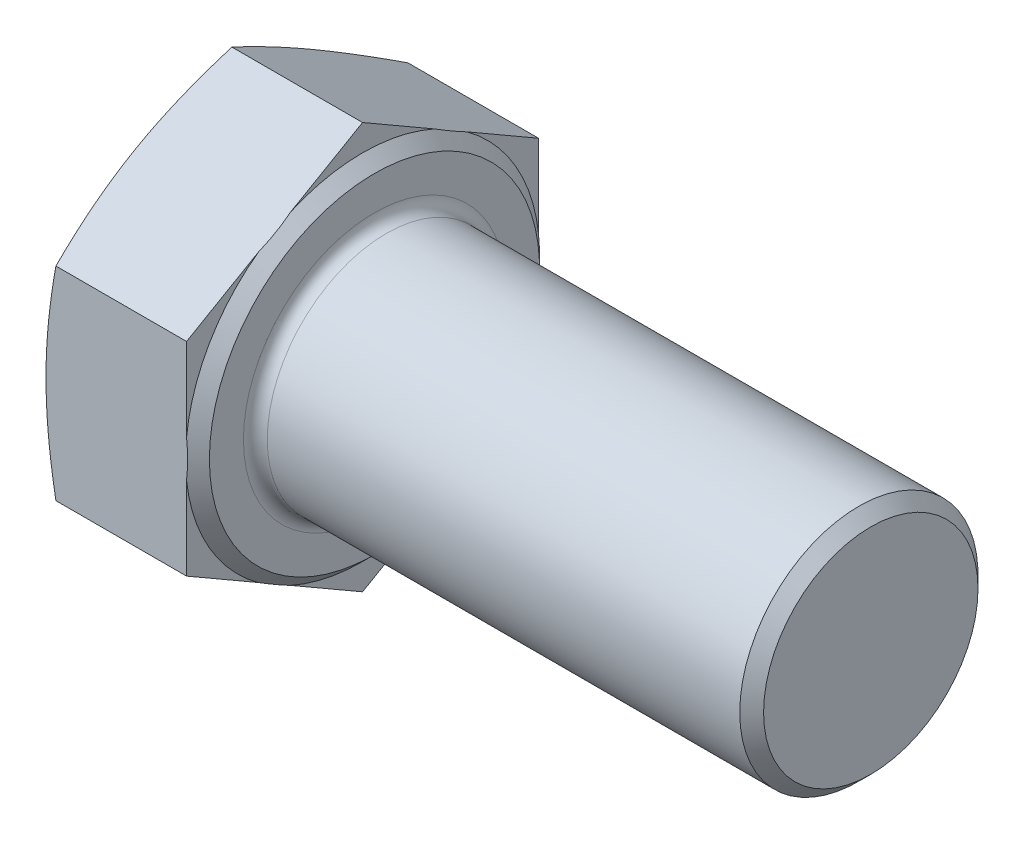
ISO-10303-21;
HEADER;
FILE_DESCRIPTION(('STEP AP214'),'2;1');
FILE_NAME('part.step','',(''),(''),'','','');
FILE_SCHEMA(('AUTOMOTIVE_DESIGN { 1 0 10303 214 1 1 1 1 }'));
ENDSEC;
DATA;
#1=APPLICATION_CONTEXT('core data for automotive mechanical design processes');
#2=APPLICATION_PROTOCOL_DEFINITION('international standard','automotive_design',2000,#1);
#3=PRODUCT_CONTEXT('',#1,'mechanical');
#4=PRODUCT('Part','Part','',(#3));
#5=PRODUCT_RELATED_PRODUCT_CATEGORY('part','',(#4));
#6=PRODUCT_DEFINITION_FORMATION('','',#4);
#7=PRODUCT_DEFINITION_CONTEXT('part definition',#1,'design');
#8=PRODUCT_DEFINITION('design','',#6,#7);
#9=PRODUCT_DEFINITION_SHAPE('','',#8);
#10=(LENGTH_UNIT() NAMED_UNIT(*) SI_UNIT(.MILLI.,.METRE.));
#11=(NAMED_UNIT(*) PLANE_ANGLE_UNIT() SI_UNIT($,.RADIAN.));
#12=(NAMED_UNIT(*) SI_UNIT($,.STERADIAN.) SOLID_ANGLE_UNIT());
#13=UNCERTAINTY_MEASURE_WITH_UNIT(LENGTH_MEASURE(1.E-05),#10,'distance_accuracy_value','');
#14=(GEOMETRIC_REPRESENTATION_CONTEXT(3) GLOBAL_UNCERTAINTY_ASSIGNED_CONTEXT((#13)) GLOBAL_UNIT_ASSIGNED_CONTEXT((#10,
#11,#12)) REPRESENTATION_CONTEXT('',''));
#15=CARTESIAN_POINT('',(0.,0.,0.));
#16=DIRECTION('',(0.,0.,1.));
#17=DIRECTION('',(1.,0.,0.));
#18=AXIS2_PLACEMENT_3D('',#15,#16,#17);
#19=CARTESIAN_POINT('',(7.68,-5.11821013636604,-8.865));
#20=DIRECTION('',(1.,0.,0.));
#21=DIRECTION('',(0.,0.,-1.));
#22=AXIS2_PLACEMENT_3D('',#19,#20,#21);
#23=PLANE('',#22);
#24=CARTESIAN_POINT('',(7.68,0.,0.));
#25=DIRECTION('',(1.,0.,0.));
#26=DIRECTION('',(0.,0.,-1.));
#27=AXIS2_PLACEMENT_3D('',#24,#25,#26);
#28=CIRCLE('',#27,6.6);
#29=CARTESIAN_POINT('',(7.68,0.,-6.6));
#30=VERTEX_POINT('',#29);
#31=EDGE_CURVE('E11',#30,#30,#28,.F.);
#32=ORIENTED_EDGE('',*,*,#31,.T.);
#33=EDGE_LOOP('',(#32));
#34=FACE_BOUND('',#33,.T.);
#35=CARTESIAN_POINT('',(7.68,0.,0.));
#36=DIRECTION('',(-1.,0.,0.));
#37=DIRECTION('',(0.,0.,1.));
#38=AXIS2_PLACEMENT_3D('',#35,#36,#37);
#39=CIRCLE('',#38,8.315);
#40=CARTESIAN_POINT('',(7.68,0.,8.315));
#41=VERTEX_POINT('',#40);
#42=EDGE_CURVE('E393',#41,#41,#39,.T.);
#43=ORIENTED_EDGE('',*,*,#42,.F.);
#44=EDGE_LOOP('',(#43));
#45=FACE_BOUND('',#44,.T.);
#46=ADVANCED_FACE('F34',(#34,#45),#23,.T.);
#47=CARTESIAN_POINT('',(7.68,-10.2364202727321,0.));
#48=DIRECTION('',(0.,0.866025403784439,0.5));
#49=DIRECTION('',(0.,-0.5,0.866025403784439));
#50=AXIS2_PLACEMENT_3D('',#47,#48,#49);
#51=PLANE('',#50);
#52=CARTESIAN_POINT('',(0.499198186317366,-5.1180946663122,-8.8652));
#53=CARTESIAN_POINT('',(0.422020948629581,-5.33006052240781,-8.49806436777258));
#54=CARTESIAN_POINT('',(0.351814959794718,-5.542725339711,-8.1297180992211));
#55=CARTESIAN_POINT('',(0.228298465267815,-5.96943771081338,-7.39063059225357));
#56=CARTESIAN_POINT('',(0.175001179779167,-6.18348621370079,-7.01988770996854));
#57=CARTESIAN_POINT('',(0.0887943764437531,-6.61059056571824,-6.28012127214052));
#58=CARTESIAN_POINT('',(0.0556968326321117,-6.82363666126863,-5.91111461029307));
#59=CARTESIAN_POINT('',(0.0113037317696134,-7.25022705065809,-5.17223838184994));
#60=CARTESIAN_POINT('',(0.,-7.46377112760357,-4.80236919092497));
#61=CARTESIAN_POINT('',(0.,-7.89085928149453,-4.06263080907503));
#62=CARTESIAN_POINT('',(0.0113037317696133,-8.10440335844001,-3.69276161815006));
#63=CARTESIAN_POINT('',(0.0556968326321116,-8.53099374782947,-2.95388538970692));
#64=CARTESIAN_POINT('',(0.0887943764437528,-8.74403984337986,-2.58487872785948));
#65=CARTESIAN_POINT('',(0.175001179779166,-9.17114419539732,-1.84511229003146));
#66=CARTESIAN_POINT('',(0.228298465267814,-9.38519269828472,-1.47436940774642));
#67=CARTESIAN_POINT('',(0.351814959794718,-9.81190506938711,-0.735281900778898));
#68=CARTESIAN_POINT('',(0.422020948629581,-10.0245698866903,-0.366935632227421));
#69=CARTESIAN_POINT('',(0.499198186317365,-10.2365357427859,0.000199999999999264));
#70=B_SPLINE_CURVE_WITH_KNOTS('',3,(#52,#53,#54,#55,#56,#57,#58,#59,#60,#61,#62,#63,#64,#65,#66,
#67,#68,#69),.UNSPECIFIED.,.F.,.F.,(4,2,2,2,2,2,2,2,4),(0.,1.29283198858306,2.58667231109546,
3.86827775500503,5.14940238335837,6.43052701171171,7.71213245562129,9.00597277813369,
10.2988047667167),.UNSPECIFIED.);
#71=CARTESIAN_POINT('',(0.4991561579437,-5.11821013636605,-8.865));
#72=VERTEX_POINT('',#71);
#73=CARTESIAN_POINT('',(0.,-7.67731520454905,-4.4325));
#74=VERTEX_POINT('',#73);
#75=EDGE_CURVE('E149',#72,#74,#70,.T.);
#76=ORIENTED_EDGE('',*,*,#75,.F.);
#77=DIRECTION('',(-1.,0.,0.));
#78=VECTOR('',#77,1.);
#79=CARTESIAN_POINT('',(7.68,-5.11821013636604,-8.865));
#80=LINE('',#79,#78);
#81=CARTESIAN_POINT('',(7.08,-5.11821013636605,-8.865));
#82=VERTEX_POINT('',#81);
#83=EDGE_CURVE('E178',#82,#72,#80,.T.);
#84=ORIENTED_EDGE('',*,*,#83,.F.);
#85=DIRECTION('',(0.,0.5,-0.866025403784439));
#86=VECTOR('',#85,1.);
#87=CARTESIAN_POINT('',(7.08,-10.2364202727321,0.));
#88=LINE('',#87,#86);
#89=CARTESIAN_POINT('',(7.08,-7.20588122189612,-5.24904761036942));
#90=VERTEX_POINT('',#89);
#91=EDGE_CURVE('E358',#90,#82,#88,.T.);
#92=ORIENTED_EDGE('',*,*,#91,.F.);
#93=CARTESIAN_POINT('',(7.0798,-8.14969377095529,-3.61431632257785));
#94=CARTESIAN_POINT('',(7.11326666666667,-7.99223424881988,-3.8870442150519));
#95=CARTESIAN_POINT('',(7.13,-7.83477472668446,-4.15977210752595));
#96=CARTESIAN_POINT('',(7.13,-7.51985568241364,-4.70522789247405));
#97=CARTESIAN_POINT('',(7.11326666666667,-7.36239616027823,-4.9779557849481));
#98=CARTESIAN_POINT('',(7.0798,-7.20493663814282,-5.25068367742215));
#99=B_SPLINE_CURVE_WITH_KNOTS('',3,(#93,#94,#95,#96,#97,#98),.UNSPECIFIED.,.F.,.F.,(4,2,4),(0.,
0.946089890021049,1.8921797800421),.UNSPECIFIED.);
#100=CARTESIAN_POINT('',(7.08,-8.14874918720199,-3.61595238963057));
#101=VERTEX_POINT('',#100);
#102=EDGE_CURVE('E298',#101,#90,#99,.T.);
#103=ORIENTED_EDGE('',*,*,#102,.F.);
#104=CARTESIAN_POINT('',(7.08,-10.2364202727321,0.));
#105=VERTEX_POINT('',#104);
#106=EDGE_CURVE('E362',#105,#101,#88,.T.);
#107=ORIENTED_EDGE('',*,*,#106,.F.);
#108=DIRECTION('',(-1.,0.,0.));
#109=VECTOR('',#108,1.);
#110=CARTESIAN_POINT('',(7.68,-10.2364202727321,0.));
#111=LINE('',#110,#109);
#112=CARTESIAN_POINT('',(0.4991561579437,-10.2364202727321,0.));
#113=VERTEX_POINT('',#112);
#114=EDGE_CURVE('E172',#105,#113,#111,.T.);
#115=ORIENTED_EDGE('',*,*,#114,.T.);
#116=EDGE_CURVE('E267',#74,#113,#70,.T.);
#117=ORIENTED_EDGE('',*,*,#116,.F.);
#118=EDGE_LOOP('',(#76,#84,#92,#103,#107,#115,#117));
#119=FACE_BOUND('',#118,.T.);
#120=ADVANCED_FACE('F36',(#119),#51,.F.);
#121=CARTESIAN_POINT('',(7.68,-5.11821013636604,-8.865));
#122=DIRECTION('',(0.,0.,1.));
#123=DIRECTION('',(1.,0.,0.));
#124=AXIS2_PLACEMENT_3D('',#121,#122,#123);
#125=PLANE('',#124);
#126=CARTESIAN_POINT('',(2.66729255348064,-13.5512207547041,-8.865));
#127=CARTESIAN_POINT('',(2.54516242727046,-13.1501360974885,-8.865));
#128=CARTESIAN_POINT('',(2.42445740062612,-12.7486094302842,-8.865));
#129=CARTESIAN_POINT('',(2.1866859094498,-11.9444470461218,-8.865));
#130=CARTESIAN_POINT('',(2.06961973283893,-11.5418112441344,-8.865));
#131=CARTESIAN_POINT('',(1.83971956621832,-10.7345164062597,-8.865));
#132=CARTESIAN_POINT('',(1.72689387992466,-10.3298549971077,-8.865));
#133=CARTESIAN_POINT('',(1.50679557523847,-9.51902688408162,-8.865));
#134=CARTESIAN_POINT('',(1.39952285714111,-9.1128602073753,-8.865));
#135=CARTESIAN_POINT('',(1.19318564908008,-8.30376994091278,-8.865));
#136=CARTESIAN_POINT('',(1.09403626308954,-7.9008681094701,-8.865));
#137=CARTESIAN_POINT('',(0.904178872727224,-7.09305955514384,-8.865));
#138=CARTESIAN_POINT('',(0.813471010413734,-6.68815279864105,-8.865));
#139=CARTESIAN_POINT('',(0.642611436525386,-5.87624379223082,-8.865));
#140=CARTESIAN_POINT('',(0.562456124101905,-5.46924230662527,-8.865));
#141=CARTESIAN_POINT('',(0.415142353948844,-4.65287640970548,-8.865));
#142=CARTESIAN_POINT('',(0.347983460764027,-4.2435120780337,-8.865));
#143=CARTESIAN_POINT('',(0.236040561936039,-3.46851652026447,-8.865));
#144=CARTESIAN_POINT('',(0.18959213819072,-3.10312796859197,-8.865));
#145=CARTESIAN_POINT('',(0.110966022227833,-2.37080582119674,-8.865));
#146=CARTESIAN_POINT('',(0.0787879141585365,-2.00387227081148,-8.865));
#147=CARTESIAN_POINT('',(0.0302520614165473,-1.26920440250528,-8.865));
#148=CARTESIAN_POINT('',(0.0138831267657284,-0.901470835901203,-8.865));
#149=CARTESIAN_POINT('',(-0.00220562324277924,-0.165635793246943,-8.865));
#150=CARTESIAN_POINT('',(-0.0019255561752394,0.202465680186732,-8.865));
#151=CARTESIAN_POINT('',(0.0153120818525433,0.940139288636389,-8.865));
#152=CARTESIAN_POINT('',(0.0323542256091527,1.30970941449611,-8.865));
#153=CARTESIAN_POINT('',(0.0823317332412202,2.04776414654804,-8.865));
#154=CARTESIAN_POINT('',(0.115267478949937,2.41624872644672,-8.865));
#155=CARTESIAN_POINT('',(0.195491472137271,3.15195041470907,-8.865));
#156=CARTESIAN_POINT('',(0.242792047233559,3.51916615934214,-8.865));
#157=CARTESIAN_POINT('',(0.349827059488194,4.25176055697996,-8.865));
#158=CARTESIAN_POINT('',(0.409561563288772,4.61713920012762,-8.865));
#159=CARTESIAN_POINT('',(0.542957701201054,5.36528645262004,-8.865));
#160=CARTESIAN_POINT('',(0.617188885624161,5.74795260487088,-8.865));
#161=CARTESIAN_POINT('',(0.775205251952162,6.5113198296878,-8.865));
#162=CARTESIAN_POINT('',(0.858991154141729,6.89202075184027,-8.865));
#163=CARTESIAN_POINT('',(1.03435761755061,7.6517288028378,-8.865));
#164=CARTESIAN_POINT('',(1.12594044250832,8.03073540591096,-8.865));
#165=CARTESIAN_POINT('',(1.31541098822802,8.78715202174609,-8.865));
#166=CARTESIAN_POINT('',(1.41329855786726,9.16456207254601,-8.865));
#167=CARTESIAN_POINT('',(1.61432901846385,9.91849411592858,-8.865));
#168=CARTESIAN_POINT('',(1.71747849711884,10.2950143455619,-8.865));
#169=CARTESIAN_POINT('',(1.92797370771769,11.0468783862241,-8.865));
#170=CARTESIAN_POINT('',(2.03531945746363,11.4222221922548,-8.865));
#171=CARTESIAN_POINT('',(2.25343759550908,12.1718406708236,-8.865));
#172=CARTESIAN_POINT('',(2.36420939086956,12.5461155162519,-8.865));
#173=CARTESIAN_POINT('',(2.58860690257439,13.2938096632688,-8.865));
#174=CARTESIAN_POINT('',(2.70223263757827,13.6672289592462,-8.865));
#175=CARTESIAN_POINT('',(3.04411686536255,14.7781527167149,-8.865));
#176=CARTESIAN_POINT('',(3.2758154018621,15.5145983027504,-8.865));
#177=CARTESIAN_POINT('',(3.74577835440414,16.9854197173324,-8.865));
#178=CARTESIAN_POINT('',(3.98404308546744,17.7197954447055,-8.865));
#179=CARTESIAN_POINT('',(4.4644742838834,19.1841817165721,-8.865));
#180=CARTESIAN_POINT('',(4.70662251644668,19.9141982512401,-8.865));
#181=CARTESIAN_POINT('',(5.07253100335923,21.0082896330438,-8.865));
#182=CARTESIAN_POINT('',(5.19494320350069,21.3728165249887,-8.865));
#183=CARTESIAN_POINT('',(5.44055969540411,22.1016024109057,-8.865));
#184=CARTESIAN_POINT('',(5.56376398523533,22.4658614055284,-8.865));
#185=CARTESIAN_POINT('',(5.68731140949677,22.8300040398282,-8.865));
#186=B_SPLINE_CURVE_WITH_KNOTS('',3,(#126,#127,#128,#129,#130,#131,#132,#133,#134,#135,#136,
#137,#138,#139,#140,#141,#142,#143,#144,#145,#146,#147,#148,#149,#150,#151,#152,#153,#154,#155,
#156,#157,#158,#159,#160,#161,#162,#163,#164,#165,#166,#167,#168,#169,#170,#171,#172,#173,#174,
#175,#176,#177,#178,#179,#180,#181,#182,#183,#184,#185),.UNSPECIFIED.,.F.,.F.,(4,2,2,2,2,2,2,2,
2,2,2,2,2,2,2,2,2,2,2,2,2,2,2,2,2,2,2,2,2,4),(0.,1.25780938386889,2.51571803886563,
3.77597363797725,5.03620660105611,6.28090154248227,7.52561742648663,8.76990746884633,
10.0141558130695,11.118900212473,12.2236124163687,13.3275421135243,14.4314640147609,
15.5409844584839,16.6505315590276,17.7610335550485,18.8715415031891,20.0407904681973,
21.2101276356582,22.379805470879,23.5494552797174,24.7206072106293,25.8917641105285,
27.0627194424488,28.233682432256,30.549734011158,32.8658968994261,35.1732714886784,
36.3268658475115,37.4804573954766),.UNSPECIFIED.);
#187=CARTESIAN_POINT('',(0.4991561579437,5.11821013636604,-8.865));
#188=VERTEX_POINT('',#187);
#189=CARTESIAN_POINT('',(0.,0.,-8.865));
#190=VERTEX_POINT('',#189);
#191=EDGE_CURVE('E278',#188,#190,#186,.F.);
#192=ORIENTED_EDGE('',*,*,#191,.F.);
#193=DIRECTION('',(-1.,0.,0.));
#194=VECTOR('',#193,1.);
#195=CARTESIAN_POINT('',(7.68,5.11821013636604,-8.865));
#196=LINE('',#195,#194);
#197=CARTESIAN_POINT('',(7.08,5.11821013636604,-8.865));
#198=VERTEX_POINT('',#197);
#199=EDGE_CURVE('E169',#198,#188,#196,.T.);
#200=ORIENTED_EDGE('',*,*,#199,.F.);
#201=DIRECTION('',(0.,1.,0.));
#202=VECTOR('',#201,1.);
#203=CARTESIAN_POINT('',(7.08,-5.11821013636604,-8.865));
#204=LINE('',#203,#202);
#205=CARTESIAN_POINT('',(7.08,0.942867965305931,-8.865));
#206=VERTEX_POINT('',#205);
#207=EDGE_CURVE('E355',#206,#198,#204,.T.);
#208=ORIENTED_EDGE('',*,*,#207,.F.);
#209=CARTESIAN_POINT('',(5.91281716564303,-4.80231045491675,-8.865));
#210=CARTESIAN_POINT('',(6.04763585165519,-4.51913406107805,-8.865));
#211=CARTESIAN_POINT('',(6.17515621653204,-4.23218217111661,-8.865));
#212=CARTESIAN_POINT('',(6.41179256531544,-3.64979088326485,-8.865));
#213=CARTESIAN_POINT('',(6.52085004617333,-3.35432785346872,-8.865));
#214=CARTESIAN_POINT('',(6.71521118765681,-2.75773602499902,-8.865));
#215=CARTESIAN_POINT('',(6.80066844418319,-2.4566581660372,-8.865));
#216=CARTESIAN_POINT('',(6.94417783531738,-1.84830814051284,-8.865));
#217=CARTESIAN_POINT('',(7.00226551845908,-1.54104455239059,-8.865));
#218=CARTESIAN_POINT('',(7.07505877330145,-1.01216911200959,-8.865));
#219=CARTESIAN_POINT('',(7.0974646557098,-0.791603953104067,-8.865));
#220=CARTESIAN_POINT('',(7.12586090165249,-0.349369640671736,-8.865));
#221=CARTESIAN_POINT('',(7.13184932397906,-0.127700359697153,-8.865));
#222=CARTESIAN_POINT('',(7.12715498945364,0.315604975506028,-8.865));
#223=CARTESIAN_POINT('',(7.11646134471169,0.53724091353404,-8.865));
#224=CARTESIAN_POINT('',(7.07881745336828,0.979071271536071,-8.865));
#225=CARTESIAN_POINT('',(7.05186917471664,1.19926586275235,-8.865));
#226=CARTESIAN_POINT('',(6.96538716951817,1.74660590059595,-8.865));
#227=CARTESIAN_POINT('',(6.89630201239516,2.07226255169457,-8.865));
#228=CARTESIAN_POINT('',(6.72846287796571,2.71615698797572,-8.865));
#229=CARTESIAN_POINT('',(6.62966369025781,3.03438266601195,-8.865));
#230=CARTESIAN_POINT('',(6.40734934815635,3.66358844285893,-8.865));
#231=CARTESIAN_POINT('',(6.28372531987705,3.97452963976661,-8.865));
#232=CARTESIAN_POINT('',(6.08393757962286,4.43394346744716,-8.865));
#233=CARTESIAN_POINT('',(6.01507836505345,4.58566409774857,-8.865));
#234=CARTESIAN_POINT('',(5.87306150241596,4.88702722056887,-8.865));
#235=CARTESIAN_POINT('',(5.7999051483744,5.03667032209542,-8.865));
#236=CARTESIAN_POINT('',(5.72484319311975,5.18535397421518,-8.865));
#237=B_SPLINE_CURVE_WITH_KNOTS('',3,(#209,#210,#211,#212,#213,#214,#215,#216,#217,#218,#219,
#220,#221,#222,#223,#224,#225,#226,#227,#228,#229,#230,#231,#232,#233,#234,#235,#236),
.UNSPECIFIED.,.F.,.F.,(4,2,2,2,2,2,2,2,2,2,2,2,2,4),(0.,0.941201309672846,1.88533132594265,
2.82316358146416,3.75977436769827,4.42431513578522,5.08893447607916,5.75398777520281,
6.41896057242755,7.4159233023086,8.41441066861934,9.41737667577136,9.9171701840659,
10.4168139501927),.UNSPECIFIED.);
#238=CARTESIAN_POINT('',(7.08,-0.942867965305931,-8.865));
#239=VERTEX_POINT('',#238);
#240=EDGE_CURVE('E292',#239,#206,#237,.T.);
#241=ORIENTED_EDGE('',*,*,#240,.F.);
#242=EDGE_CURVE('E356',#82,#239,#204,.T.);
#243=ORIENTED_EDGE('',*,*,#242,.F.);
#244=ORIENTED_EDGE('',*,*,#83,.T.);
#245=EDGE_CURVE('E160',#190,#72,#186,.F.);
#246=ORIENTED_EDGE('',*,*,#245,.F.);
#247=EDGE_LOOP('',(#192,#200,#208,#241,#243,#244,#246));
#248=FACE_BOUND('',#247,.T.);
#249=ADVANCED_FACE('F218',(#248),#125,.F.);
#250=CARTESIAN_POINT('',(7.68,5.11821013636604,-8.865));
#251=DIRECTION('',(0.,-0.866025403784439,0.5));
#252=DIRECTION('',(0.,-0.5,-0.866025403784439));
#253=AXIS2_PLACEMENT_3D('',#250,#251,#252);
#254=PLANE('',#253);
#255=CARTESIAN_POINT('',(0.499198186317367,10.2365357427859,0.000199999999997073));
#256=CARTESIAN_POINT('',(0.422020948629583,10.0245698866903,-0.366935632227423));
#257=CARTESIAN_POINT('',(0.35181495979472,9.81190506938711,-0.7352819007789));
#258=CARTESIAN_POINT('',(0.228298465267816,9.38519269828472,-1.47436940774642));
#259=CARTESIAN_POINT('',(0.175001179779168,9.17114419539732,-1.84511229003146));
#260=CARTESIAN_POINT('',(0.0887943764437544,8.74403984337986,-2.58487872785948));
#261=CARTESIAN_POINT('',(0.0556968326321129,8.53099374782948,-2.95388538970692));
#262=CARTESIAN_POINT('',(0.0113037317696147,8.10440335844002,-3.69276161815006));
#263=CARTESIAN_POINT('',(0.,7.89085928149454,-4.06263080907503));
#264=CARTESIAN_POINT('',(0.,7.46377112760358,-4.80236919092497));
#265=CARTESIAN_POINT('',(0.0113037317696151,7.2502270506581,-5.17223838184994));
#266=CARTESIAN_POINT('',(0.0556968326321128,6.82363666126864,-5.91111461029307));
#267=CARTESIAN_POINT('',(0.0887943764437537,6.61059056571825,-6.28012127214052));
#268=CARTESIAN_POINT('',(0.175001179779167,6.18348621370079,-7.01988770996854));
#269=CARTESIAN_POINT('',(0.228298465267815,5.96943771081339,-7.39063059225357));
#270=CARTESIAN_POINT('',(0.351814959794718,5.542725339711,-8.1297180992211));
#271=CARTESIAN_POINT('',(0.422020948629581,5.33006052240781,-8.49806436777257));
#272=CARTESIAN_POINT('',(0.499198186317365,5.1180946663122,-8.86519999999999));
#273=B_SPLINE_CURVE_WITH_KNOTS('',3,(#255,#256,#257,#258,#259,#260,#261,#262,#263,#264,#265,
#266,#267,#268,#269,#270,#271,#272),.UNSPECIFIED.,.F.,.F.,(4,2,2,2,2,2,2,2,4),(0.,
1.29283198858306,2.58667231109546,3.86827775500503,5.14940238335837,6.43052701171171,
7.71213245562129,9.00597277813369,10.2988047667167),.UNSPECIFIED.);
#274=CARTESIAN_POINT('',(0.4991561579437,10.2364202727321,0.));
#275=VERTEX_POINT('',#274);
#276=CARTESIAN_POINT('',(0.,7.67731520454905,-4.4325));
#277=VERTEX_POINT('',#276);
#278=EDGE_CURVE('E50',#275,#277,#273,.T.);
#279=ORIENTED_EDGE('',*,*,#278,.F.);
#280=DIRECTION('',(-1.,0.,0.));
#281=VECTOR('',#280,1.);
#282=CARTESIAN_POINT('',(7.68,10.2364202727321,0.));
#283=LINE('',#282,#281);
#284=CARTESIAN_POINT('',(7.08,10.2364202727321,0.));
#285=VERTEX_POINT('',#284);
#286=EDGE_CURVE('E166',#285,#275,#283,.T.);
#287=ORIENTED_EDGE('',*,*,#286,.F.);
#288=DIRECTION('',(0.,0.5,0.866025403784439));
#289=VECTOR('',#288,1.);
#290=CARTESIAN_POINT('',(7.08,5.11821013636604,-8.865));
#291=LINE('',#290,#289);
#292=CARTESIAN_POINT('',(7.08,8.14874918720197,-3.61595238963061));
#293=VERTEX_POINT('',#292);
#294=EDGE_CURVE('E347',#293,#285,#291,.T.);
#295=ORIENTED_EDGE('',*,*,#294,.F.);
#296=CARTESIAN_POINT('',(7.0798,7.20493663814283,-5.25068367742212));
#297=CARTESIAN_POINT('',(7.11326666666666,7.36239616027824,-4.97795578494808));
#298=CARTESIAN_POINT('',(7.13,7.51985568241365,-4.70522789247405));
#299=CARTESIAN_POINT('',(7.13,7.83477472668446,-4.15977210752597));
#300=CARTESIAN_POINT('',(7.11326666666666,7.99223424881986,-3.88704421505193));
#301=CARTESIAN_POINT('',(7.0798,8.14969377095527,-3.61431632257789));
#302=B_SPLINE_CURVE_WITH_KNOTS('',3,(#296,#297,#298,#299,#300,#301),.UNSPECIFIED.,.F.,.F.,(4,2,
4),(0.,0.946089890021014,1.89217978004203),.UNSPECIFIED.);
#303=CARTESIAN_POINT('',(7.08,7.20588122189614,-5.2490476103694));
#304=VERTEX_POINT('',#303);
#305=EDGE_CURVE('E299',#304,#293,#302,.T.);
#306=ORIENTED_EDGE('',*,*,#305,.F.);
#307=EDGE_CURVE('E350',#198,#304,#291,.T.);
#308=ORIENTED_EDGE('',*,*,#307,.F.);
#309=ORIENTED_EDGE('',*,*,#199,.T.);
#310=EDGE_CURVE('E279',#277,#188,#273,.T.);
#311=ORIENTED_EDGE('',*,*,#310,.F.);
#312=EDGE_LOOP('',(#279,#287,#295,#306,#308,#309,#311));
#313=FACE_BOUND('',#312,.T.);
#314=ADVANCED_FACE('F287',(#313),#254,.F.);
#315=CARTESIAN_POINT('',(7.68,10.2364202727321,0.));
#316=DIRECTION('',(0.,-0.866025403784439,-0.5));
#317=DIRECTION('',(0.,0.5,-0.866025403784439));
#318=AXIS2_PLACEMENT_3D('',#315,#316,#317);
#319=PLANE('',#318);
#320=CARTESIAN_POINT('',(0.499198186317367,5.1180946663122,8.8652));
#321=CARTESIAN_POINT('',(0.422020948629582,5.33006052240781,8.49806436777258));
#322=CARTESIAN_POINT('',(0.351814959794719,5.54272533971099,8.1297180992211));
#323=CARTESIAN_POINT('',(0.228298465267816,5.96943771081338,7.39063059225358));
#324=CARTESIAN_POINT('',(0.175001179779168,6.18348621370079,7.01988770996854));
#325=CARTESIAN_POINT('',(0.088794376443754,6.61059056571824,6.28012127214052));
#326=CARTESIAN_POINT('',(0.0556968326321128,6.82363666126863,5.91111461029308));
#327=CARTESIAN_POINT('',(0.0113037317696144,7.25022705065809,5.17223838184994));
#328=CARTESIAN_POINT('',(0.,7.46377112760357,4.80236919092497));
#329=CARTESIAN_POINT('',(0.,7.89085928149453,4.06263080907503));
#330=CARTESIAN_POINT('',(0.0113037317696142,8.10440335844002,3.69276161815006));
#331=CARTESIAN_POINT('',(0.0556968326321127,8.53099374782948,2.95388538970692));
#332=CARTESIAN_POINT('',(0.088794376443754,8.74403984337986,2.58487872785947));
#333=CARTESIAN_POINT('',(0.175001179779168,9.17114419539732,1.84511229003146));
#334=CARTESIAN_POINT('',(0.228298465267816,9.38519269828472,1.47436940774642));
#335=CARTESIAN_POINT('',(0.351814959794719,9.81190506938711,0.735281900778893));
#336=CARTESIAN_POINT('',(0.422020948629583,10.0245698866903,0.366935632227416));
#337=CARTESIAN_POINT('',(0.499198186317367,10.2365357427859,-0.000200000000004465));
#338=B_SPLINE_CURVE_WITH_KNOTS('',3,(#320,#321,#322,#323,#324,#325,#326,#327,#328,#329,#330,
#331,#332,#333,#334,#335,#336,#337),.UNSPECIFIED.,.F.,.F.,(4,2,2,2,2,2,2,2,4),(0.,
1.29283198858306,2.58667231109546,3.86827775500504,5.14940238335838,6.43052701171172,
7.7121324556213,9.0059727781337,10.2988047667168),.UNSPECIFIED.);
#339=CARTESIAN_POINT('',(0.4991561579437,5.11821013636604,8.865));
#340=VERTEX_POINT('',#339);
#341=CARTESIAN_POINT('',(0.,7.67731520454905,4.4325));
#342=VERTEX_POINT('',#341);
#343=EDGE_CURVE('E58',#340,#342,#338,.T.);
#344=ORIENTED_EDGE('',*,*,#343,.F.);
#345=DIRECTION('',(-1.,0.,0.));
#346=VECTOR('',#345,1.);
#347=CARTESIAN_POINT('',(7.68,5.11821013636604,8.865));
#348=LINE('',#347,#346);
#349=CARTESIAN_POINT('',(7.08,5.11821013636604,8.865));
#350=VERTEX_POINT('',#349);
#351=EDGE_CURVE('E157',#350,#340,#348,.T.);
#352=ORIENTED_EDGE('',*,*,#351,.F.);
#353=DIRECTION('',(0.,-0.5,0.866025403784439));
#354=VECTOR('',#353,1.);
#355=CARTESIAN_POINT('',(7.08,10.2364202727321,0.));
#356=LINE('',#355,#354);
#357=CARTESIAN_POINT('',(7.08,7.20588122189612,5.24904761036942));
#358=VERTEX_POINT('',#357);
#359=EDGE_CURVE('E348',#358,#350,#356,.T.);
#360=ORIENTED_EDGE('',*,*,#359,.F.);
#361=CARTESIAN_POINT('',(7.0798,8.14969377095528,3.61431632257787));
#362=CARTESIAN_POINT('',(7.11326666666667,7.99223424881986,3.88704421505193));
#363=CARTESIAN_POINT('',(7.13,7.83477472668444,4.15977210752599));
#364=CARTESIAN_POINT('',(7.13,7.51985568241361,4.70522789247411));
#365=CARTESIAN_POINT('',(7.11326666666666,7.36239616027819,4.97795578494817));
#366=CARTESIAN_POINT('',(7.07979999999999,7.20493663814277,5.25068367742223));
#367=B_SPLINE_CURVE_WITH_KNOTS('',3,(#361,#362,#363,#364,#365,#366),.UNSPECIFIED.,.F.,.F.,(4,2,
4),(0.,0.946089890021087,1.89217978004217),.UNSPECIFIED.);
#368=CARTESIAN_POINT('',(7.08,8.14874918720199,3.61595238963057));
#369=VERTEX_POINT('',#368);
#370=EDGE_CURVE('E323',#369,#358,#367,.T.);
#371=ORIENTED_EDGE('',*,*,#370,.F.);
#372=EDGE_CURVE('E343',#285,#369,#356,.T.);
#373=ORIENTED_EDGE('',*,*,#372,.F.);
#374=ORIENTED_EDGE('',*,*,#286,.T.);
#375=EDGE_CURVE('E159',#342,#275,#338,.T.);
#376=ORIENTED_EDGE('',*,*,#375,.F.);
#377=EDGE_LOOP('',(#344,#352,#360,#371,#373,#374,#376));
#378=FACE_BOUND('',#377,.T.);
#379=ADVANCED_FACE('F155',(#378),#319,.F.);
#380=CARTESIAN_POINT('',(7.68,5.11821013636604,8.865));
#381=DIRECTION('',(0.,0.,-1.));
#382=DIRECTION('',(-1.,0.,0.));
#383=AXIS2_PLACEMENT_3D('',#380,#381,#382);
#384=PLANE('',#383);
#385=CARTESIAN_POINT('',(2.66729255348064,-13.5512207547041,8.865));
#386=CARTESIAN_POINT('',(2.54516242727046,-13.1501360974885,8.865));
#387=CARTESIAN_POINT('',(2.42445740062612,-12.7486094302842,8.865));
#388=CARTESIAN_POINT('',(2.1866859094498,-11.9444470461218,8.865));
#389=CARTESIAN_POINT('',(2.06961973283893,-11.5418112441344,8.865));
#390=CARTESIAN_POINT('',(1.83971956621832,-10.7345164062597,8.865));
#391=CARTESIAN_POINT('',(1.72689387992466,-10.3298549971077,8.865));
#392=CARTESIAN_POINT('',(1.50679557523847,-9.51902688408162,8.865));
#393=CARTESIAN_POINT('',(1.39952285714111,-9.1128602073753,8.865));
#394=CARTESIAN_POINT('',(1.19318564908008,-8.30376994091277,8.865));
#395=CARTESIAN_POINT('',(1.09403626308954,-7.9008681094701,8.865));
#396=CARTESIAN_POINT('',(0.904178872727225,-7.09305955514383,8.865));
#397=CARTESIAN_POINT('',(0.813471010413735,-6.68815279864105,8.865));
#398=CARTESIAN_POINT('',(0.642611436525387,-5.87624379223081,8.865));
#399=CARTESIAN_POINT('',(0.562456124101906,-5.46924230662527,8.865));
#400=CARTESIAN_POINT('',(0.415142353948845,-4.65287640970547,8.865));
#401=CARTESIAN_POINT('',(0.347983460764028,-4.2435120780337,8.865));
#402=CARTESIAN_POINT('',(0.23604056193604,-3.46851652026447,8.865));
#403=CARTESIAN_POINT('',(0.189592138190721,-3.10312796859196,8.865));
#404=CARTESIAN_POINT('',(0.110966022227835,-2.37080582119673,8.865));
#405=CARTESIAN_POINT('',(0.0787879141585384,-2.00387227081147,8.865));
#406=CARTESIAN_POINT('',(0.0302520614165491,-1.26920440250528,8.865));
#407=CARTESIAN_POINT('',(0.0138831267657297,-0.901470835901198,8.865));
#408=CARTESIAN_POINT('',(-0.00220562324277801,-0.165635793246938,8.865));
#409=CARTESIAN_POINT('',(-0.00192555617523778,0.202465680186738,8.865));
#410=CARTESIAN_POINT('',(0.0153120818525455,0.940139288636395,8.865));
#411=CARTESIAN_POINT('',(0.032354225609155,1.30970941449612,8.865));
#412=CARTESIAN_POINT('',(0.0823317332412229,2.04776414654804,8.865));
#413=CARTESIAN_POINT('',(0.115267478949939,2.41624872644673,8.865));
#414=CARTESIAN_POINT('',(0.195491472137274,3.15195041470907,8.865));
#415=CARTESIAN_POINT('',(0.242792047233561,3.51916615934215,8.865));
#416=CARTESIAN_POINT('',(0.349827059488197,4.25176055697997,8.865));
#417=CARTESIAN_POINT('',(0.409561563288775,4.61713920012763,8.865));
#418=CARTESIAN_POINT('',(0.542957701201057,5.36528645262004,8.865));
#419=CARTESIAN_POINT('',(0.617188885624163,5.74795260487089,8.865));
#420=CARTESIAN_POINT('',(0.775205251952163,6.5113198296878,8.865));
#421=CARTESIAN_POINT('',(0.858991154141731,6.89202075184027,8.865));
#422=CARTESIAN_POINT('',(1.03435761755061,7.6517288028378,8.865));
#423=CARTESIAN_POINT('',(1.12594044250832,8.03073540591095,8.865));
#424=CARTESIAN_POINT('',(1.31541098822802,8.78715202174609,8.865));
#425=CARTESIAN_POINT('',(1.41329855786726,9.16456207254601,8.865));
#426=CARTESIAN_POINT('',(1.61432901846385,9.91849411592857,8.865));
#427=CARTESIAN_POINT('',(1.71747849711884,10.2950143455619,8.865));
#428=CARTESIAN_POINT('',(1.92797370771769,11.0468783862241,8.865));
#429=CARTESIAN_POINT('',(2.03531945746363,11.4222221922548,8.865));
#430=CARTESIAN_POINT('',(2.25343759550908,12.1718406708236,8.865));
#431=CARTESIAN_POINT('',(2.36420939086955,12.5461155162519,8.865));
#432=CARTESIAN_POINT('',(2.58860690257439,13.2938096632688,8.865));
#433=CARTESIAN_POINT('',(2.70223263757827,13.6672289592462,8.865));
#434=CARTESIAN_POINT('',(3.04411686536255,14.7781527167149,8.865));
#435=CARTESIAN_POINT('',(3.2758154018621,15.5145983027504,8.865));
#436=CARTESIAN_POINT('',(3.74577835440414,16.9854197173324,8.865));
#437=CARTESIAN_POINT('',(3.98404308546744,17.7197954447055,8.865));
#438=CARTESIAN_POINT('',(4.4644742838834,19.1841817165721,8.865));
#439=CARTESIAN_POINT('',(4.70662251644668,19.9141982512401,8.865));
#440=CARTESIAN_POINT('',(5.07253100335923,21.0082896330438,8.865));
#441=CARTESIAN_POINT('',(5.19494320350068,21.3728165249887,8.865));
#442=CARTESIAN_POINT('',(5.44055969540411,22.1016024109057,8.865));
#443=CARTESIAN_POINT('',(5.56376398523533,22.4658614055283,8.865));
#444=CARTESIAN_POINT('',(5.68731140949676,22.8300040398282,8.865));
#445=B_SPLINE_CURVE_WITH_KNOTS('',3,(#385,#386,#387,#388,#389,#390,#391,#392,#393,#394,#395,
#396,#397,#398,#399,#400,#401,#402,#403,#404,#405,#406,#407,#408,#409,#410,#411,#412,#413,#414,
#415,#416,#417,#418,#419,#420,#421,#422,#423,#424,#425,#426,#427,#428,#429,#430,#431,#432,#433,
#434,#435,#436,#437,#438,#439,#440,#441,#442,#443,#444),.UNSPECIFIED.,.F.,.F.,(4,2,2,2,2,2,2,2,
2,2,2,2,2,2,2,2,2,2,2,2,2,2,2,2,2,2,2,2,2,4),(0.,1.25780938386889,2.51571803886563,
3.77597363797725,5.03620660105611,6.28090154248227,7.52561742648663,8.76990746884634,
10.0141558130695,11.118900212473,12.2236124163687,13.3275421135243,14.431464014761,
15.5409844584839,16.6505315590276,17.7610335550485,18.8715415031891,20.0407904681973,
21.2101276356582,22.379805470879,23.5494552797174,24.7206072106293,25.8917641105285,
27.0627194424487,28.233682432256,30.549734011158,32.865896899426,35.1732714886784,
36.3268658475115,37.4804573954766),.UNSPECIFIED.);
#446=CARTESIAN_POINT('',(0.4991561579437,-5.11821013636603,8.86500000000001));
#447=VERTEX_POINT('',#446);
#448=CARTESIAN_POINT('',(0.,0.,8.865));
#449=VERTEX_POINT('',#448);
#450=EDGE_CURVE('E151',#447,#449,#445,.T.);
#451=ORIENTED_EDGE('',*,*,#450,.F.);
#452=DIRECTION('',(-1.,0.,0.));
#453=VECTOR('',#452,1.);
#454=CARTESIAN_POINT('',(7.68,-5.11821013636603,8.865));
#455=LINE('',#454,#453);
#456=CARTESIAN_POINT('',(7.08,-5.11821013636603,8.86500000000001));
#457=VERTEX_POINT('',#456);
#458=EDGE_CURVE('E167',#457,#447,#455,.T.);
#459=ORIENTED_EDGE('',*,*,#458,.F.);
#460=DIRECTION('',(0.,-1.,0.));
#461=VECTOR('',#460,1.);
#462=CARTESIAN_POINT('',(7.08,5.11821013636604,8.865));
#463=LINE('',#462,#461);
#464=CARTESIAN_POINT('',(7.08,-0.942867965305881,8.865));
#465=VERTEX_POINT('',#464);
#466=EDGE_CURVE('E353',#465,#457,#463,.T.);
#467=ORIENTED_EDGE('',*,*,#466,.F.);
#468=CARTESIAN_POINT('',(5.91281716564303,-4.80231045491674,8.865));
#469=CARTESIAN_POINT('',(6.04763585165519,-4.51913406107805,8.865));
#470=CARTESIAN_POINT('',(6.17515621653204,-4.23218217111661,8.865));
#471=CARTESIAN_POINT('',(6.41179256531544,-3.64979088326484,8.865));
#472=CARTESIAN_POINT('',(6.52085004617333,-3.35432785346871,8.865));
#473=CARTESIAN_POINT('',(6.71521118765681,-2.75773602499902,8.865));
#474=CARTESIAN_POINT('',(6.80066844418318,-2.4566581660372,8.865));
#475=CARTESIAN_POINT('',(6.94417783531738,-1.84830814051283,8.865));
#476=CARTESIAN_POINT('',(7.00226551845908,-1.54104455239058,8.865));
#477=CARTESIAN_POINT('',(7.07505877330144,-1.01216911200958,8.865));
#478=CARTESIAN_POINT('',(7.09746465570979,-0.791603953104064,8.865));
#479=CARTESIAN_POINT('',(7.12586090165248,-0.349369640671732,8.865));
#480=CARTESIAN_POINT('',(7.13184932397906,-0.127700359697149,8.865));
#481=CARTESIAN_POINT('',(7.12715498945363,0.315604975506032,8.865));
#482=CARTESIAN_POINT('',(7.11646134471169,0.537240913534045,8.865));
#483=CARTESIAN_POINT('',(7.07881745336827,0.979071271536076,8.865));
#484=CARTESIAN_POINT('',(7.05186917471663,1.19926586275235,8.865));
#485=CARTESIAN_POINT('',(6.96538716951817,1.74660590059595,8.865));
#486=CARTESIAN_POINT('',(6.89630201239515,2.07226255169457,8.865));
#487=CARTESIAN_POINT('',(6.72846287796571,2.71615698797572,8.865));
#488=CARTESIAN_POINT('',(6.6296636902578,3.03438266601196,8.865));
#489=CARTESIAN_POINT('',(6.40734934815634,3.66358844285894,8.865));
#490=CARTESIAN_POINT('',(6.28372531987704,3.97452963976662,8.865));
#491=CARTESIAN_POINT('',(6.08393757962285,4.43394346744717,8.865));
#492=CARTESIAN_POINT('',(6.01507836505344,4.58566409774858,8.865));
#493=CARTESIAN_POINT('',(5.87306150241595,4.88702722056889,8.865));
#494=CARTESIAN_POINT('',(5.79990514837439,5.03667032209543,8.865));
#495=CARTESIAN_POINT('',(5.72484319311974,5.18535397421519,8.865));
#496=B_SPLINE_CURVE_WITH_KNOTS('',3,(#468,#469,#470,#471,#472,#473,#474,#475,#476,#477,#478,
#479,#480,#481,#482,#483,#484,#485,#486,#487,#488,#489,#490,#491,#492,#493,#494,#495),
.UNSPECIFIED.,.F.,.F.,(4,2,2,2,2,2,2,2,2,2,2,2,2,4),(0.,0.941201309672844,1.88533132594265,
2.82316358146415,3.75977436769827,4.42431513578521,5.08893447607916,5.75398777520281,
6.41896057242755,7.4159233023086,8.41441066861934,9.41737667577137,9.91717018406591,
10.4168139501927),.UNSPECIFIED.);
#497=CARTESIAN_POINT('',(7.08,0.942867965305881,8.865));
#498=VERTEX_POINT('',#497);
#499=EDGE_CURVE('E318',#498,#465,#496,.F.);
#500=ORIENTED_EDGE('',*,*,#499,.F.);
#501=EDGE_CURVE('E165',#350,#498,#463,.T.);
#502=ORIENTED_EDGE('',*,*,#501,.F.);
#503=ORIENTED_EDGE('',*,*,#351,.T.);
#504=EDGE_CURVE('E141',#449,#340,#445,.T.);
#505=ORIENTED_EDGE('',*,*,#504,.F.);
#506=EDGE_LOOP('',(#451,#459,#467,#500,#502,#503,#505));
#507=FACE_BOUND('',#506,.T.);
#508=ADVANCED_FACE('F163',(#507),#384,.F.);
#509=CARTESIAN_POINT('',(7.68,-5.11821013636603,8.865));
#510=DIRECTION('',(0.,0.866025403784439,-0.5));
#511=DIRECTION('',(0.,0.5,0.866025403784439));
#512=AXIS2_PLACEMENT_3D('',#509,#510,#511);
#513=PLANE('',#512);
#514=CARTESIAN_POINT('',(0.499198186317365,-10.2365357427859,-0.000199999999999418));
#515=CARTESIAN_POINT('',(0.42202094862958,-10.0245698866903,0.366935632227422));
#516=CARTESIAN_POINT('',(0.351814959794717,-9.81190506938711,0.735281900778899));
#517=CARTESIAN_POINT('',(0.228298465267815,-9.38519269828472,1.47436940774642));
#518=CARTESIAN_POINT('',(0.175001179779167,-9.17114419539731,1.84511229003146));
#519=CARTESIAN_POINT('',(0.0887943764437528,-8.74403984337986,2.58487872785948));
#520=CARTESIAN_POINT('',(0.0556968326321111,-8.53099374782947,2.95388538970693));
#521=CARTESIAN_POINT('',(0.0113037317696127,-8.10440335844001,3.69276161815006));
#522=CARTESIAN_POINT('',(0.,-7.89085928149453,4.06263080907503));
#523=CARTESIAN_POINT('',(0.,-7.46377112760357,4.80236919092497));
#524=CARTESIAN_POINT('',(0.0113037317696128,-7.25022705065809,5.17223838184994));
#525=CARTESIAN_POINT('',(0.055696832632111,-6.82363666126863,5.91111461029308));
#526=CARTESIAN_POINT('',(0.0887943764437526,-6.61059056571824,6.28012127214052));
#527=CARTESIAN_POINT('',(0.175001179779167,-6.18348621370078,7.01988770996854));
#528=CARTESIAN_POINT('',(0.228298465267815,-5.96943771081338,7.39063059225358));
#529=CARTESIAN_POINT('',(0.351814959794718,-5.54272533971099,8.1297180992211));
#530=CARTESIAN_POINT('',(0.422020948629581,-5.3300605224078,8.49806436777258));
#531=CARTESIAN_POINT('',(0.499198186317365,-5.11809466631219,8.8652));
#532=B_SPLINE_CURVE_WITH_KNOTS('',3,(#514,#515,#516,#517,#518,#519,#520,#521,#522,#523,#524,
#525,#526,#527,#528,#529,#530,#531),.UNSPECIFIED.,.F.,.F.,(4,2,2,2,2,2,2,2,4),(0.,
1.29283198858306,2.58667231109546,3.86827775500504,5.14940238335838,6.43052701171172,
7.71213245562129,9.00597277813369,10.2988047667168),.UNSPECIFIED.);
#533=CARTESIAN_POINT('',(0.,-7.67731520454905,4.4325));
#534=VERTEX_POINT('',#533);
#535=EDGE_CURVE('E248',#113,#534,#532,.T.);
#536=ORIENTED_EDGE('',*,*,#535,.F.);
#537=ORIENTED_EDGE('',*,*,#114,.F.);
#538=DIRECTION('',(0.,-0.5,-0.866025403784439));
#539=VECTOR('',#538,1.);
#540=CARTESIAN_POINT('',(7.08,-5.11821013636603,8.865));
#541=LINE('',#540,#539);
#542=CARTESIAN_POINT('',(7.08,-8.14874918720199,3.61595238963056));
#543=VERTEX_POINT('',#542);
#544=EDGE_CURVE('E181',#543,#105,#541,.T.);
#545=ORIENTED_EDGE('',*,*,#544,.F.);
#546=CARTESIAN_POINT('',(7.07979999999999,-7.20493663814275,5.25068367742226));
#547=CARTESIAN_POINT('',(7.11326666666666,-7.36239616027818,4.97795578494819));
#548=CARTESIAN_POINT('',(7.13,-7.5198556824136,4.70522789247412));
#549=CARTESIAN_POINT('',(7.13,-7.83477472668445,4.15977210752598));
#550=CARTESIAN_POINT('',(7.11326666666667,-7.99223424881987,3.88704421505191));
#551=CARTESIAN_POINT('',(7.0798,-8.14969377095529,3.61431632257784));
#552=B_SPLINE_CURVE_WITH_KNOTS('',3,(#546,#547,#548,#549,#550,#551),.UNSPECIFIED.,.F.,.F.,(4,2,
4),(0.,0.94608989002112,1.89217978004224),.UNSPECIFIED.);
#553=CARTESIAN_POINT('',(7.08,-7.20588122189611,5.24904761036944));
#554=VERTEX_POINT('',#553);
#555=EDGE_CURVE('E235',#554,#543,#552,.T.);
#556=ORIENTED_EDGE('',*,*,#555,.F.);
#557=EDGE_CURVE('E183',#457,#554,#541,.T.);
#558=ORIENTED_EDGE('',*,*,#557,.F.);
#559=ORIENTED_EDGE('',*,*,#458,.T.);
#560=EDGE_CURVE('E242',#534,#447,#532,.T.);
#561=ORIENTED_EDGE('',*,*,#560,.F.);
#562=EDGE_LOOP('',(#536,#537,#545,#556,#558,#559,#561));
#563=FACE_BOUND('',#562,.T.);
#564=ADVANCED_FACE('F225',(#563),#513,.F.);
#565=CARTESIAN_POINT('',(7.08,8.915,0.));
#566=DIRECTION('',(1.,0.,0.));
#567=DIRECTION('',(0.,0.,-1.));
#568=AXIS2_PLACEMENT_3D('',#565,#566,#567);
#569=PLANE('',#568);
#570=ORIENTED_EDGE('',*,*,#91,.T.);
#571=ORIENTED_EDGE('',*,*,#242,.T.);
#572=CARTESIAN_POINT('',(7.08,0.,0.));
#573=DIRECTION('',(-1.,0.,0.));
#574=DIRECTION('',(0.,0.,1.));
#575=AXIS2_PLACEMENT_3D('',#572,#573,#574);
#576=CIRCLE('',#575,8.915);
#577=EDGE_CURVE('E372',#239,#90,#576,.T.);
#578=ORIENTED_EDGE('',*,*,#577,.T.);
#579=EDGE_LOOP('',(#570,#571,#578));
#580=FACE_BOUND('',#579,.T.);
#581=ADVANCED_FACE('F229',(#580),#569,.T.);
#582=ORIENTED_EDGE('',*,*,#207,.T.);
#583=ORIENTED_EDGE('',*,*,#307,.T.);
#584=EDGE_CURVE('E376',#304,#206,#576,.T.);
#585=ORIENTED_EDGE('',*,*,#584,.T.);
#586=EDGE_LOOP('',(#582,#583,#585));
#587=FACE_BOUND('',#586,.T.);
#588=ADVANCED_FACE('F388',(#587),#569,.T.);
#589=ORIENTED_EDGE('',*,*,#294,.T.);
#590=ORIENTED_EDGE('',*,*,#372,.T.);
#591=EDGE_CURVE('E390',#369,#293,#576,.T.);
#592=ORIENTED_EDGE('',*,*,#591,.T.);
#593=EDGE_LOOP('',(#589,#590,#592));
#594=FACE_BOUND('',#593,.T.);
#595=ADVANCED_FACE('F417',(#594),#569,.T.);
#596=ORIENTED_EDGE('',*,*,#359,.T.);
#597=ORIENTED_EDGE('',*,*,#501,.T.);
#598=EDGE_CURVE('E391',#498,#358,#576,.T.);
#599=ORIENTED_EDGE('',*,*,#598,.T.);
#600=EDGE_LOOP('',(#596,#597,#599));
#601=FACE_BOUND('',#600,.T.);
#602=ADVANCED_FACE('F412',(#601),#569,.T.);
#603=ORIENTED_EDGE('',*,*,#466,.T.);
#604=ORIENTED_EDGE('',*,*,#557,.T.);
#605=EDGE_CURVE('E340',#554,#465,#576,.T.);
#606=ORIENTED_EDGE('',*,*,#605,.T.);
#607=EDGE_LOOP('',(#603,#604,#606));
#608=FACE_BOUND('',#607,.T.);
#609=ADVANCED_FACE('F403',(#608),#569,.T.);
#610=ORIENTED_EDGE('',*,*,#106,.T.);
#611=EDGE_CURVE('E375',#101,#543,#576,.T.);
#612=ORIENTED_EDGE('',*,*,#611,.T.);
#613=ORIENTED_EDGE('',*,*,#544,.T.);
#614=EDGE_LOOP('',(#610,#612,#613));
#615=FACE_BOUND('',#614,.T.);
#616=ADVANCED_FACE('F312',(#615),#569,.T.);
#617=CARTESIAN_POINT('',(7.08,0.,0.));
#618=DIRECTION('',(-1.,0.,0.));
#619=DIRECTION('',(0.,0.,1.));
#620=AXIS2_PLACEMENT_3D('',#617,#618,#619);
#621=CONICAL_SURFACE('',#620,8.915,0.785398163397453);
#622=ORIENTED_EDGE('',*,*,#42,.T.);
#623=EDGE_LOOP('',(#622));
#624=FACE_BOUND('',#623,.T.);
#625=ORIENTED_EDGE('',*,*,#102,.T.);
#626=ORIENTED_EDGE('',*,*,#577,.F.);
#627=ORIENTED_EDGE('',*,*,#240,.T.);
#628=ORIENTED_EDGE('',*,*,#584,.F.);
#629=ORIENTED_EDGE('',*,*,#305,.T.);
#630=ORIENTED_EDGE('',*,*,#591,.F.);
#631=ORIENTED_EDGE('',*,*,#370,.T.);
#632=ORIENTED_EDGE('',*,*,#598,.F.);
#633=ORIENTED_EDGE('',*,*,#499,.T.);
#634=ORIENTED_EDGE('',*,*,#605,.F.);
#635=ORIENTED_EDGE('',*,*,#555,.T.);
#636=ORIENTED_EDGE('',*,*,#611,.F.);
#637=EDGE_LOOP('',(#625,#626,#627,#628,#629,#630,#631,#632,#633,#634,#635,#636));
#638=FACE_BOUND('',#637,.T.);
#639=ADVANCED_FACE('F308',(#624,#638),#621,.T.);
#640=CARTESIAN_POINT('',(0.,0.,0.));
#641=DIRECTION('',(1.,0.,0.));
#642=DIRECTION('',(0.,0.,-1.));
#643=AXIS2_PLACEMENT_3D('',#640,#641,#642);
#644=CONICAL_SURFACE('',#643,8.865,1.22173047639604);
#645=ORIENTED_EDGE('',*,*,#245,.T.);
#646=ORIENTED_EDGE('',*,*,#75,.T.);
#647=CARTESIAN_POINT('',(0.,0.,0.));
#648=DIRECTION('',(1.,0.,0.));
#649=DIRECTION('',(0.,0.,-1.));
#650=AXIS2_PLACEMENT_3D('',#647,#648,#649);
#651=CIRCLE('',#650,8.865);
#652=EDGE_CURVE('E184',#74,#190,#651,.T.);
#653=ORIENTED_EDGE('',*,*,#652,.T.);
#654=EDGE_LOOP('',(#645,#646,#653));
#655=FACE_BOUND('',#654,.T.);
#656=ADVANCED_FACE('F311',(#655),#644,.T.);
#657=ORIENTED_EDGE('',*,*,#116,.T.);
#658=ORIENTED_EDGE('',*,*,#535,.T.);
#659=EDGE_CURVE('E187',#534,#74,#651,.T.);
#660=ORIENTED_EDGE('',*,*,#659,.T.);
#661=EDGE_LOOP('',(#657,#658,#660));
#662=FACE_BOUND('',#661,.T.);
#663=ADVANCED_FACE('F436',(#662),#644,.T.);
#664=ORIENTED_EDGE('',*,*,#450,.T.);
#665=EDGE_CURVE('E431',#449,#534,#651,.T.);
#666=ORIENTED_EDGE('',*,*,#665,.T.);
#667=ORIENTED_EDGE('',*,*,#560,.T.);
#668=EDGE_LOOP('',(#664,#666,#667));
#669=FACE_BOUND('',#668,.T.);
#670=ADVANCED_FACE('F259',(#669),#644,.T.);
#671=ORIENTED_EDGE('',*,*,#343,.T.);
#672=CARTESIAN_POINT('',(0.,0.,0.));
#673=DIRECTION('',(-1.,0.,0.));
#674=DIRECTION('',(0.,0.,1.));
#675=AXIS2_PLACEMENT_3D('',#672,#673,#674);
#676=CIRCLE('',#675,8.865);
#677=EDGE_CURVE('E144',#449,#342,#676,.T.);
#678=ORIENTED_EDGE('',*,*,#677,.F.);
#679=ORIENTED_EDGE('',*,*,#504,.T.);
#680=EDGE_LOOP('',(#671,#678,#679));
#681=FACE_BOUND('',#680,.T.);
#682=ADVANCED_FACE('F142',(#681),#644,.T.);
#683=ORIENTED_EDGE('',*,*,#278,.T.);
#684=EDGE_CURVE('E430',#277,#342,#651,.T.);
#685=ORIENTED_EDGE('',*,*,#684,.T.);
#686=ORIENTED_EDGE('',*,*,#375,.T.);
#687=EDGE_LOOP('',(#683,#685,#686));
#688=FACE_BOUND('',#687,.T.);
#689=ADVANCED_FACE('F253',(#688),#644,.T.);
#690=ORIENTED_EDGE('',*,*,#310,.T.);
#691=ORIENTED_EDGE('',*,*,#191,.T.);
#692=EDGE_CURVE('E188',#190,#277,#651,.T.);
#693=ORIENTED_EDGE('',*,*,#692,.T.);
#694=EDGE_LOOP('',(#690,#691,#693));
#695=FACE_BOUND('',#694,.T.);
#696=ADVANCED_FACE('F258',(#695),#644,.T.);
#697=CARTESIAN_POINT('',(0.,-5.11821013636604,-8.865));
#698=DIRECTION('',(1.,0.,0.));
#699=DIRECTION('',(0.,0.,-1.));
#700=AXIS2_PLACEMENT_3D('',#697,#698,#699);
#701=PLANE('',#700);
#702=ORIENTED_EDGE('',*,*,#692,.F.);
#703=ORIENTED_EDGE('',*,*,#652,.F.);
#704=ORIENTED_EDGE('',*,*,#659,.F.);
#705=ORIENTED_EDGE('',*,*,#665,.F.);
#706=ORIENTED_EDGE('',*,*,#677,.T.);
#707=ORIENTED_EDGE('',*,*,#684,.F.);
#708=EDGE_LOOP('',(#702,#703,#704,#705,#706,#707));
#709=FACE_BOUND('',#708,.T.);
#710=ADVANCED_FACE('F223',(#709),#701,.F.);
#711=CARTESIAN_POINT('',(32.68,0.,0.));
#712=DIRECTION('',(-1.,0.,0.));
#713=DIRECTION('',(0.,0.,1.));
#714=AXIS2_PLACEMENT_3D('',#711,#712,#713);
#715=CYLINDRICAL_SURFACE('',#714,6.);
#716=CARTESIAN_POINT('',(8.28,0.,0.));
#717=DIRECTION('',(1.,0.,0.));
#718=DIRECTION('',(0.,0.,-1.));
#719=AXIS2_PLACEMENT_3D('',#716,#717,#718);
#720=CIRCLE('',#719,6.);
#721=CARTESIAN_POINT('',(8.28,0.,-6.));
#722=VERTEX_POINT('',#721);
#723=EDGE_CURVE('E43',#722,#722,#720,.T.);
#724=ORIENTED_EDGE('',*,*,#723,.T.);
#725=EDGE_LOOP('',(#724));
#726=FACE_BOUND('',#725,.T.);
#727=CARTESIAN_POINT('',(32.08,0.,0.));
#728=DIRECTION('',(1.,0.,0.));
#729=DIRECTION('',(0.,0.,-1.));
#730=AXIS2_PLACEMENT_3D('',#727,#728,#729);
#731=CIRCLE('',#730,6.);
#732=CARTESIAN_POINT('',(32.08,0.,6.));
#733=VERTEX_POINT('',#732);
#734=EDGE_CURVE('E192',#733,#733,#731,.F.);
#735=ORIENTED_EDGE('',*,*,#734,.T.);
#736=EDGE_LOOP('',(#735));
#737=FACE_BOUND('',#736,.T.);
#738=ADVANCED_FACE('F197',(#726,#737),#715,.T.);
#739=CARTESIAN_POINT('',(32.68,0.,0.));
#740=DIRECTION('',(1.,0.,0.));
#741=DIRECTION('',(0.,0.,-1.));
#742=AXIS2_PLACEMENT_3D('',#739,#740,#741);
#743=PLANE('',#742);
#744=CARTESIAN_POINT('',(32.68,0.,0.));
#745=DIRECTION('',(1.,0.,0.));
#746=DIRECTION('',(0.,0.,-1.));
#747=AXIS2_PLACEMENT_3D('',#744,#745,#746);
#748=CIRCLE('',#747,5.39999999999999);
#749=CARTESIAN_POINT('',(32.68,0.,5.4));
#750=VERTEX_POINT('',#749);
#751=EDGE_CURVE('E189',#750,#750,#748,.T.);
#752=ORIENTED_EDGE('',*,*,#751,.T.);
#753=EDGE_LOOP('',(#752));
#754=FACE_BOUND('',#753,.T.);
#755=ADVANCED_FACE('F208',(#754),#743,.T.);
#756=CARTESIAN_POINT('',(32.68,0.,0.));
#757=DIRECTION('',(-1.,0.,0.));
#758=DIRECTION('',(0.,0.,1.));
#759=AXIS2_PLACEMENT_3D('',#756,#757,#758);
#760=CONICAL_SURFACE('',#759,5.39999999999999,0.785398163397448);
#761=CARTESIAN_POINT('',(32.08,0.,6.));
#762=CARTESIAN_POINT('',(32.08625,0.,5.99375));
#763=CARTESIAN_POINT('',(32.0925,0.,5.9875));
#764=CARTESIAN_POINT('',(32.105,0.,5.975));
#765=CARTESIAN_POINT('',(32.11125,0.,5.96875));
#766=CARTESIAN_POINT('',(32.12375,0.,5.95625));
#767=CARTESIAN_POINT('',(32.13,0.,5.95));
#768=CARTESIAN_POINT('',(32.1425,0.,5.9375));
#769=CARTESIAN_POINT('',(32.14875,0.,5.93125));
#770=CARTESIAN_POINT('',(32.16125,0.,5.91875));
#771=CARTESIAN_POINT('',(32.1675,0.,5.9125));
#772=CARTESIAN_POINT('',(32.18,0.,5.9));
#773=CARTESIAN_POINT('',(32.18625,0.,5.89375));
#774=CARTESIAN_POINT('',(32.19875,0.,5.88125));
#775=CARTESIAN_POINT('',(32.205,0.,5.875));
#776=CARTESIAN_POINT('',(32.2175,0.,5.8625));
#777=CARTESIAN_POINT('',(32.22375,0.,5.85625));
#778=CARTESIAN_POINT('',(32.23625,0.,5.84375));
#779=CARTESIAN_POINT('',(32.2425,0.,5.8375));
#780=CARTESIAN_POINT('',(32.255,0.,5.825));
#781=CARTESIAN_POINT('',(32.26125,0.,5.81875));
#782=CARTESIAN_POINT('',(32.27375,0.,5.80625));
#783=CARTESIAN_POINT('',(32.28,0.,5.8));
#784=CARTESIAN_POINT('',(32.2925,0.,5.7875));
#785=CARTESIAN_POINT('',(32.29875,0.,5.78125));
#786=CARTESIAN_POINT('',(32.31125,0.,5.76875));
#787=CARTESIAN_POINT('',(32.3175,0.,5.7625));
#788=CARTESIAN_POINT('',(32.33,0.,5.75));
#789=CARTESIAN_POINT('',(32.33625,0.,5.74375));
#790=CARTESIAN_POINT('',(32.34875,0.,5.73125));
#791=CARTESIAN_POINT('',(32.355,0.,5.725));
#792=CARTESIAN_POINT('',(32.3675,0.,5.7125));
#793=CARTESIAN_POINT('',(32.37375,0.,5.70625));
#794=CARTESIAN_POINT('',(32.38625,0.,5.69375));
#795=CARTESIAN_POINT('',(32.3925,0.,5.6875));
#796=CARTESIAN_POINT('',(32.405,0.,5.675));
#797=CARTESIAN_POINT('',(32.41125,0.,5.66875));
#798=CARTESIAN_POINT('',(32.42375,0.,5.65625));
#799=CARTESIAN_POINT('',(32.43,0.,5.65));
#800=CARTESIAN_POINT('',(32.4425,0.,5.6375));
#801=CARTESIAN_POINT('',(32.44875,0.,5.63125));
#802=CARTESIAN_POINT('',(32.46125,0.,5.61875));
#803=CARTESIAN_POINT('',(32.4675,0.,5.6125));
#804=CARTESIAN_POINT('',(32.48,0.,5.6));
#805=CARTESIAN_POINT('',(32.48625,0.,5.59375));
#806=CARTESIAN_POINT('',(32.49875,0.,5.58125));
#807=CARTESIAN_POINT('',(32.505,0.,5.575));
#808=CARTESIAN_POINT('',(32.5175,0.,5.5625));
#809=CARTESIAN_POINT('',(32.52375,0.,5.55625));
#810=CARTESIAN_POINT('',(32.53625,0.,5.54375));
#811=CARTESIAN_POINT('',(32.5425,0.,5.5375));
#812=CARTESIAN_POINT('',(32.555,0.,5.525));
#813=CARTESIAN_POINT('',(32.56125,0.,5.51875));
#814=CARTESIAN_POINT('',(32.57375,0.,5.50625));
#815=CARTESIAN_POINT('',(32.58,0.,5.5));
#816=CARTESIAN_POINT('',(32.5925,0.,5.4875));
#817=CARTESIAN_POINT('',(32.59875,0.,5.48125));
#818=CARTESIAN_POINT('',(32.61125,0.,5.46875));
#819=CARTESIAN_POINT('',(32.6175,0.,5.4625));
#820=CARTESIAN_POINT('',(32.63,0.,5.45));
#821=CARTESIAN_POINT('',(32.63625,0.,5.44375));
#822=CARTESIAN_POINT('',(32.64875,0.,5.43125));
#823=CARTESIAN_POINT('',(32.655,0.,5.425));
#824=CARTESIAN_POINT('',(32.6675,0.,5.41249999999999));
#825=CARTESIAN_POINT('',(32.67375,0.,5.40624999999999));
#826=CARTESIAN_POINT('',(32.68,0.,5.4));
#827=B_SPLINE_CURVE_WITH_KNOTS('',3,(#761,#762,#763,#764,#765,#766,#767,#768,#769,#770,#771,
#772,#773,#774,#775,#776,#777,#778,#779,#780,#781,#782,#783,#784,#785,#786,#787,#788,#789,#790,
#791,#792,#793,#794,#795,#796,#797,#798,#799,#800,#801,#802,#803,#804,#805,#806,#807,#808,#809,
#810,#811,#812,#813,#814,#815,#816,#817,#818,#819,#820,#821,#822,#823,#824,#825,#826),
.UNSPECIFIED.,.F.,.F.,(4,2,2,2,2,2,2,2,2,2,2,2,2,2,2,2,2,2,2,2,2,2,2,2,2,2,2,2,2,2,2,2,4),(0.,
0.0265165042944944,0.0530330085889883,0.0795495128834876,0.106066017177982,0.132582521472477,
0.159099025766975,0.18561553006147,0.212132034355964,0.238648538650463,0.265165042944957,
0.291681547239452,0.318198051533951,0.344714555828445,0.371231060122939,0.397747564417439,
0.424264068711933,0.450780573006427,0.477297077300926,0.503813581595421,0.530330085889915,
0.556846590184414,0.583363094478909,0.609879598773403,0.636396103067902,0.662912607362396,
0.689429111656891,0.71594561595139,0.742462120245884,0.768978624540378,0.795495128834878,
0.822011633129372,0.848528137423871),.UNSPECIFIED.);
#828=EDGE_CURVE('BSEAM202',#733,#750,#827,.T.);
#829=ORIENTED_EDGE('',*,*,#734,.F.);
#830=ORIENTED_EDGE('',*,*,#751,.F.);
#831=ORIENTED_EDGE('',*,*,#828,.T.);
#832=ORIENTED_EDGE('',*,*,#828,.F.);
#833=EDGE_LOOP('',(#829,#831,#830,#832));
#834=FACE_BOUND('',#833,.T.);
#835=ADVANCED_FACE('F202',(#834),#760,.T.);
#836=CARTESIAN_POINT('',(8.28,0.,0.));
#837=DIRECTION('',(1.,0.,0.));
#838=DIRECTION('',(0.,0.,-1.));
#839=AXIS2_PLACEMENT_3D('',#836,#837,#838);
#840=TOROIDAL_SURFACE('',#839,6.6,0.6);
#841=ORIENTED_EDGE('',*,*,#31,.F.);
#842=EDGE_LOOP('',(#841));
#843=FACE_BOUND('',#842,.T.);
#844=ORIENTED_EDGE('',*,*,#723,.F.);
#845=EDGE_LOOP('',(#844));
#846=FACE_BOUND('',#845,.T.);
#847=ADVANCED_FACE('F200',(#843,#846),#840,.F.);
#848=CLOSED_SHELL('',(#46,#120,#249,#314,#379,#508,#564,#581,#588,#595,#602,#609,#616,#639,#656,
#663,#670,#682,#689,#696,#710,#738,#755,#835,#847));
#849=MANIFOLD_SOLID_BREP('B2',#848);
#850=ADVANCED_BREP_SHAPE_REPRESENTATION('',(#18,#849),#14);
#851=SHAPE_DEFINITION_REPRESENTATION(#9,#850);
ENDSEC;
END-ISO-10303-21;
